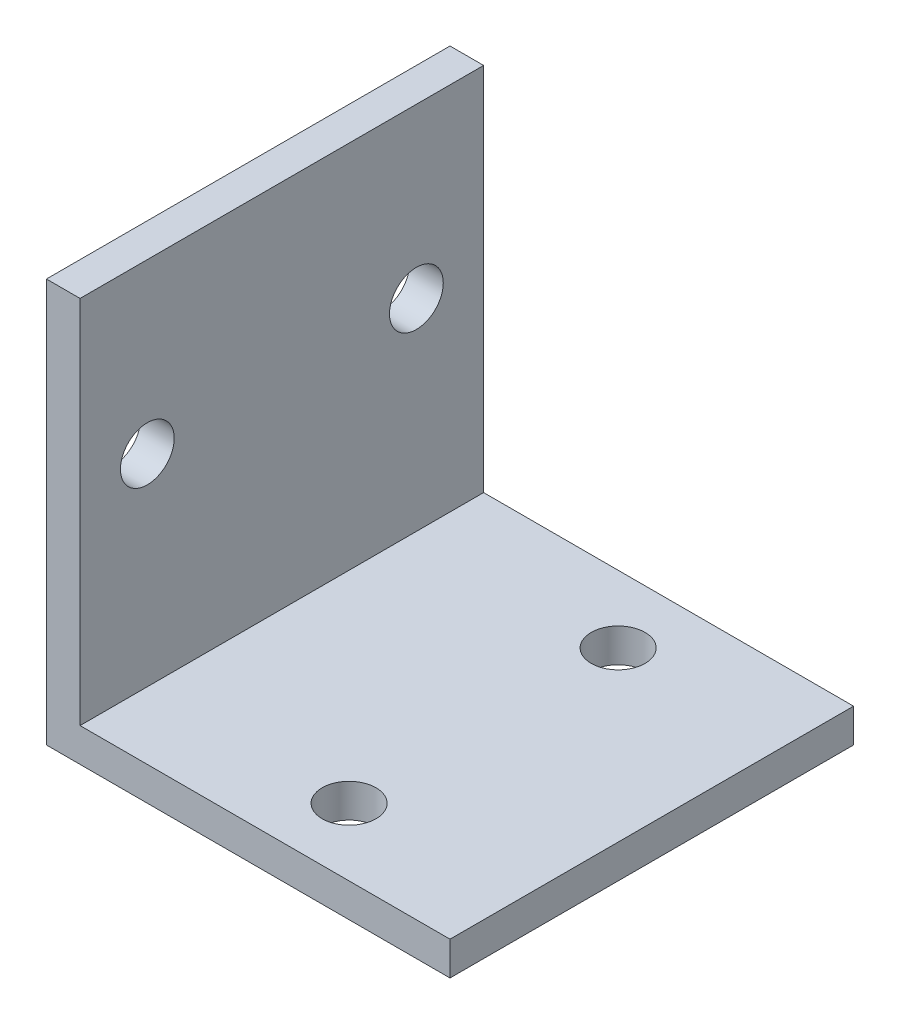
ISO-10303-21;
HEADER;
FILE_DESCRIPTION(('STEP AP214'),'2;1');
FILE_NAME('part.step','',(''),(''),'','','');
FILE_SCHEMA(('AUTOMOTIVE_DESIGN { 1 0 10303 214 1 1 1 1 }'));
ENDSEC;
DATA;
#1=APPLICATION_CONTEXT('core data for automotive mechanical design processes');
#2=APPLICATION_PROTOCOL_DEFINITION('international standard','automotive_design',2000,#1);
#3=PRODUCT_CONTEXT('',#1,'mechanical');
#4=PRODUCT('Part','Part','',(#3));
#5=PRODUCT_RELATED_PRODUCT_CATEGORY('part','',(#4));
#6=PRODUCT_DEFINITION_FORMATION('','',#4);
#7=PRODUCT_DEFINITION_CONTEXT('part definition',#1,'design');
#8=PRODUCT_DEFINITION('design','',#6,#7);
#9=PRODUCT_DEFINITION_SHAPE('','',#8);
#10=(LENGTH_UNIT() NAMED_UNIT(*) SI_UNIT(.MILLI.,.METRE.));
#11=(NAMED_UNIT(*) PLANE_ANGLE_UNIT() SI_UNIT($,.RADIAN.));
#12=(NAMED_UNIT(*) SI_UNIT($,.STERADIAN.) SOLID_ANGLE_UNIT());
#13=UNCERTAINTY_MEASURE_WITH_UNIT(LENGTH_MEASURE(1.E-05),#10,'distance_accuracy_value','');
#14=(GEOMETRIC_REPRESENTATION_CONTEXT(3) GLOBAL_UNCERTAINTY_ASSIGNED_CONTEXT((#13)) GLOBAL_UNIT_ASSIGNED_CONTEXT((#10,
#11,#12)) REPRESENTATION_CONTEXT('',''));
#15=CARTESIAN_POINT('',(0.,0.,0.));
#16=DIRECTION('',(0.,0.,1.));
#17=DIRECTION('',(1.,0.,0.));
#18=AXIS2_PLACEMENT_3D('',#15,#16,#17);
#19=CARTESIAN_POINT('',(0.,60.,30.));
#20=DIRECTION('',(0.,-1.,0.));
#21=DIRECTION('',(0.,0.,-1.));
#22=AXIS2_PLACEMENT_3D('',#19,#20,#21);
#23=PLANE('',#22);
#24=DIRECTION('',(-1.,0.,0.));
#25=VECTOR('',#24,1.);
#26=CARTESIAN_POINT('',(0.,60.,-30.));
#27=LINE('',#26,#25);
#28=CARTESIAN_POINT('',(5.,60.,-30.));
#29=VERTEX_POINT('',#28);
#30=CARTESIAN_POINT('',(0.,60.,-30.));
#31=VERTEX_POINT('',#30);
#32=EDGE_CURVE('E122',#29,#31,#27,.T.);
#33=ORIENTED_EDGE('',*,*,#32,.T.);
#34=DIRECTION('',(0.,0.,-1.));
#35=VECTOR('',#34,1.);
#36=CARTESIAN_POINT('',(0.,60.,30.));
#37=LINE('',#36,#35);
#38=CARTESIAN_POINT('',(0.,60.,30.));
#39=VERTEX_POINT('',#38);
#40=EDGE_CURVE('E11',#39,#31,#37,.T.);
#41=ORIENTED_EDGE('',*,*,#40,.F.);
#42=DIRECTION('',(-1.,0.,0.));
#43=VECTOR('',#42,1.);
#44=CARTESIAN_POINT('',(0.,60.,30.));
#45=LINE('',#44,#43);
#46=CARTESIAN_POINT('',(5.,60.,30.));
#47=VERTEX_POINT('',#46);
#48=EDGE_CURVE('E133',#47,#39,#45,.T.);
#49=ORIENTED_EDGE('',*,*,#48,.F.);
#50=DIRECTION('',(0.,0.,-1.));
#51=VECTOR('',#50,1.);
#52=CARTESIAN_POINT('',(5.,60.,30.));
#53=LINE('',#52,#51);
#54=EDGE_CURVE('E118',#47,#29,#53,.T.);
#55=ORIENTED_EDGE('',*,*,#54,.T.);
#56=EDGE_LOOP('',(#33,#41,#49,#55));
#57=FACE_BOUND('',#56,.T.);
#58=ADVANCED_FACE('F38',(#57),#23,.F.);
#59=CARTESIAN_POINT('',(0.,60.,30.));
#60=DIRECTION('',(1.,0.,0.));
#61=DIRECTION('',(0.,1.,0.));
#62=AXIS2_PLACEMENT_3D('',#59,#60,#61);
#63=PLANE('',#62);
#64=CARTESIAN_POINT('',(0.,35.,20.));
#65=DIRECTION('',(1.,0.,0.));
#66=DIRECTION('',(0.,0.,-1.));
#67=AXIS2_PLACEMENT_3D('',#64,#65,#66);
#68=CIRCLE('',#67,4.);
#69=CARTESIAN_POINT('',(0.,35.,16.));
#70=VERTEX_POINT('',#69);
#71=EDGE_CURVE('E284',#70,#70,#68,.T.);
#72=ORIENTED_EDGE('',*,*,#71,.T.);
#73=EDGE_LOOP('',(#72));
#74=FACE_BOUND('',#73,.T.);
#75=CARTESIAN_POINT('',(0.,35.,-20.));
#76=DIRECTION('',(1.,0.,0.));
#77=DIRECTION('',(0.,0.,-1.));
#78=AXIS2_PLACEMENT_3D('',#75,#76,#77);
#79=CIRCLE('',#78,4.);
#80=CARTESIAN_POINT('',(0.,35.,-24.));
#81=VERTEX_POINT('',#80);
#82=EDGE_CURVE('E287',#81,#81,#79,.T.);
#83=ORIENTED_EDGE('',*,*,#82,.T.);
#84=EDGE_LOOP('',(#83));
#85=FACE_BOUND('',#84,.T.);
#86=DIRECTION('',(0.,-1.,0.));
#87=VECTOR('',#86,1.);
#88=CARTESIAN_POINT('',(0.,60.,-30.));
#89=LINE('',#88,#87);
#90=CARTESIAN_POINT('',(0.,0.,-30.));
#91=VERTEX_POINT('',#90);
#92=EDGE_CURVE('E125',#31,#91,#89,.T.);
#93=ORIENTED_EDGE('',*,*,#92,.T.);
#94=DIRECTION('',(0.,0.,-1.));
#95=VECTOR('',#94,1.);
#96=CARTESIAN_POINT('',(0.,0.,30.));
#97=LINE('',#96,#95);
#98=CARTESIAN_POINT('',(0.,0.,30.));
#99=VERTEX_POINT('',#98);
#100=EDGE_CURVE('E46',#99,#91,#97,.T.);
#101=ORIENTED_EDGE('',*,*,#100,.F.);
#102=DIRECTION('',(0.,-1.,0.));
#103=VECTOR('',#102,1.);
#104=CARTESIAN_POINT('',(0.,60.,30.));
#105=LINE('',#104,#103);
#106=EDGE_CURVE('E91',#39,#99,#105,.T.);
#107=ORIENTED_EDGE('',*,*,#106,.F.);
#108=ORIENTED_EDGE('',*,*,#40,.T.);
#109=EDGE_LOOP('',(#93,#101,#107,#108));
#110=FACE_BOUND('',#109,.T.);
#111=ADVANCED_FACE('F161',(#74,#85,#110),#63,.F.);
#112=CARTESIAN_POINT('',(0.,0.,30.));
#113=DIRECTION('',(0.,1.,0.));
#114=DIRECTION('',(0.,0.,1.));
#115=AXIS2_PLACEMENT_3D('',#112,#113,#114);
#116=PLANE('',#115);
#117=CARTESIAN_POINT('',(35.,0.,-20.));
#118=DIRECTION('',(0.,1.,0.));
#119=DIRECTION('',(0.,0.,1.));
#120=AXIS2_PLACEMENT_3D('',#117,#118,#119);
#121=CIRCLE('',#120,4.00000000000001);
#122=CARTESIAN_POINT('',(35.,0.,-16.));
#123=VERTEX_POINT('',#122);
#124=EDGE_CURVE('E126',#123,#123,#121,.T.);
#125=ORIENTED_EDGE('',*,*,#124,.T.);
#126=EDGE_LOOP('',(#125));
#127=FACE_BOUND('',#126,.T.);
#128=CARTESIAN_POINT('',(35.,0.,20.));
#129=DIRECTION('',(0.,1.,0.));
#130=DIRECTION('',(0.,0.,1.));
#131=AXIS2_PLACEMENT_3D('',#128,#129,#130);
#132=CIRCLE('',#131,4.00000000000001);
#133=CARTESIAN_POINT('',(35.,0.,24.));
#134=VERTEX_POINT('',#133);
#135=EDGE_CURVE('E302',#134,#134,#132,.T.);
#136=ORIENTED_EDGE('',*,*,#135,.T.);
#137=EDGE_LOOP('',(#136));
#138=FACE_BOUND('',#137,.T.);
#139=DIRECTION('',(1.,0.,0.));
#140=VECTOR('',#139,1.);
#141=CARTESIAN_POINT('',(0.,0.,-30.));
#142=LINE('',#141,#140);
#143=CARTESIAN_POINT('',(60.,0.,-30.));
#144=VERTEX_POINT('',#143);
#145=EDGE_CURVE('E128',#91,#144,#142,.T.);
#146=ORIENTED_EDGE('',*,*,#145,.T.);
#147=DIRECTION('',(0.,0.,-1.));
#148=VECTOR('',#147,1.);
#149=CARTESIAN_POINT('',(60.,0.,30.));
#150=LINE('',#149,#148);
#151=CARTESIAN_POINT('',(60.,0.,30.));
#152=VERTEX_POINT('',#151);
#153=EDGE_CURVE('E113',#152,#144,#150,.T.);
#154=ORIENTED_EDGE('',*,*,#153,.F.);
#155=DIRECTION('',(1.,0.,0.));
#156=VECTOR('',#155,1.);
#157=CARTESIAN_POINT('',(0.,0.,30.));
#158=LINE('',#157,#156);
#159=EDGE_CURVE('E104',#99,#152,#158,.T.);
#160=ORIENTED_EDGE('',*,*,#159,.F.);
#161=ORIENTED_EDGE('',*,*,#100,.T.);
#162=EDGE_LOOP('',(#146,#154,#160,#161));
#163=FACE_BOUND('',#162,.T.);
#164=ADVANCED_FACE('F139',(#127,#138,#163),#116,.F.);
#165=CARTESIAN_POINT('',(60.,0.,30.));
#166=DIRECTION('',(-1.,0.,0.));
#167=DIRECTION('',(0.,0.,1.));
#168=AXIS2_PLACEMENT_3D('',#165,#166,#167);
#169=PLANE('',#168);
#170=DIRECTION('',(0.,1.,0.));
#171=VECTOR('',#170,1.);
#172=CARTESIAN_POINT('',(60.,0.,-30.));
#173=LINE('',#172,#171);
#174=CARTESIAN_POINT('',(60.,5.,-30.));
#175=VERTEX_POINT('',#174);
#176=EDGE_CURVE('E112',#144,#175,#173,.T.);
#177=ORIENTED_EDGE('',*,*,#176,.T.);
#178=DIRECTION('',(0.,0.,-1.));
#179=VECTOR('',#178,1.);
#180=CARTESIAN_POINT('',(60.,5.,30.));
#181=LINE('',#180,#179);
#182=CARTESIAN_POINT('',(60.,5.,30.));
#183=VERTEX_POINT('',#182);
#184=EDGE_CURVE('E109',#183,#175,#181,.T.);
#185=ORIENTED_EDGE('',*,*,#184,.F.);
#186=DIRECTION('',(0.,1.,0.));
#187=VECTOR('',#186,1.);
#188=CARTESIAN_POINT('',(60.,0.,30.));
#189=LINE('',#188,#187);
#190=EDGE_CURVE('E98',#152,#183,#189,.T.);
#191=ORIENTED_EDGE('',*,*,#190,.F.);
#192=ORIENTED_EDGE('',*,*,#153,.T.);
#193=EDGE_LOOP('',(#177,#185,#191,#192));
#194=FACE_BOUND('',#193,.T.);
#195=ADVANCED_FACE('F110',(#194),#169,.F.);
#196=CARTESIAN_POINT('',(5.,5.,30.));
#197=DIRECTION('',(0.,-1.,0.));
#198=DIRECTION('',(0.,0.,-1.));
#199=AXIS2_PLACEMENT_3D('',#196,#197,#198);
#200=PLANE('',#199);
#201=CARTESIAN_POINT('',(35.,5.,-20.));
#202=DIRECTION('',(0.,1.,0.));
#203=DIRECTION('',(0.,0.,1.));
#204=AXIS2_PLACEMENT_3D('',#201,#202,#203);
#205=CIRCLE('',#204,4.00000000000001);
#206=CARTESIAN_POINT('',(35.,5.,-16.));
#207=VERTEX_POINT('',#206);
#208=EDGE_CURVE('E299',#207,#207,#205,.T.);
#209=ORIENTED_EDGE('',*,*,#208,.F.);
#210=EDGE_LOOP('',(#209));
#211=FACE_BOUND('',#210,.T.);
#212=CARTESIAN_POINT('',(35.,5.,20.));
#213=DIRECTION('',(0.,1.,0.));
#214=DIRECTION('',(0.,0.,1.));
#215=AXIS2_PLACEMENT_3D('',#212,#213,#214);
#216=CIRCLE('',#215,4.00000000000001);
#217=CARTESIAN_POINT('',(35.,5.,24.));
#218=VERTEX_POINT('',#217);
#219=EDGE_CURVE('E289',#218,#218,#216,.T.);
#220=ORIENTED_EDGE('',*,*,#219,.F.);
#221=EDGE_LOOP('',(#220));
#222=FACE_BOUND('',#221,.T.);
#223=DIRECTION('',(-1.,0.,0.));
#224=VECTOR('',#223,1.);
#225=CARTESIAN_POINT('',(5.,5.,-30.));
#226=LINE('',#225,#224);
#227=CARTESIAN_POINT('',(5.,5.,-30.));
#228=VERTEX_POINT('',#227);
#229=EDGE_CURVE('E77',#175,#228,#226,.T.);
#230=ORIENTED_EDGE('',*,*,#229,.T.);
#231=DIRECTION('',(0.,0.,-1.));
#232=VECTOR('',#231,1.);
#233=CARTESIAN_POINT('',(5.,5.,30.));
#234=LINE('',#233,#232);
#235=CARTESIAN_POINT('',(5.,5.,30.));
#236=VERTEX_POINT('',#235);
#237=EDGE_CURVE('E114',#236,#228,#234,.T.);
#238=ORIENTED_EDGE('',*,*,#237,.F.);
#239=DIRECTION('',(-1.,0.,0.));
#240=VECTOR('',#239,1.);
#241=CARTESIAN_POINT('',(5.,5.,30.));
#242=LINE('',#241,#240);
#243=EDGE_CURVE('E102',#183,#236,#242,.T.);
#244=ORIENTED_EDGE('',*,*,#243,.F.);
#245=ORIENTED_EDGE('',*,*,#184,.T.);
#246=EDGE_LOOP('',(#230,#238,#244,#245));
#247=FACE_BOUND('',#246,.T.);
#248=ADVANCED_FACE('F116',(#211,#222,#247),#200,.F.);
#249=CARTESIAN_POINT('',(5.,60.,30.));
#250=DIRECTION('',(-1.,0.,0.));
#251=DIRECTION('',(0.,0.,1.));
#252=AXIS2_PLACEMENT_3D('',#249,#250,#251);
#253=PLANE('',#252);
#254=CARTESIAN_POINT('',(5.,35.,20.));
#255=DIRECTION('',(1.,0.,0.));
#256=DIRECTION('',(0.,0.,-1.));
#257=AXIS2_PLACEMENT_3D('',#254,#255,#256);
#258=CIRCLE('',#257,4.);
#259=CARTESIAN_POINT('',(5.,35.,16.));
#260=VERTEX_POINT('',#259);
#261=EDGE_CURVE('E286',#260,#260,#258,.T.);
#262=ORIENTED_EDGE('',*,*,#261,.F.);
#263=EDGE_LOOP('',(#262));
#264=FACE_BOUND('',#263,.T.);
#265=CARTESIAN_POINT('',(5.,35.,-20.));
#266=DIRECTION('',(1.,0.,0.));
#267=DIRECTION('',(0.,0.,-1.));
#268=AXIS2_PLACEMENT_3D('',#265,#266,#267);
#269=CIRCLE('',#268,4.);
#270=CARTESIAN_POINT('',(5.,35.,-24.));
#271=VERTEX_POINT('',#270);
#272=EDGE_CURVE('E292',#271,#271,#269,.T.);
#273=ORIENTED_EDGE('',*,*,#272,.F.);
#274=EDGE_LOOP('',(#273));
#275=FACE_BOUND('',#274,.T.);
#276=DIRECTION('',(0.,1.,0.));
#277=VECTOR('',#276,1.);
#278=CARTESIAN_POINT('',(5.,60.,-30.));
#279=LINE('',#278,#277);
#280=EDGE_CURVE('E83',#228,#29,#279,.T.);
#281=ORIENTED_EDGE('',*,*,#280,.T.);
#282=ORIENTED_EDGE('',*,*,#54,.F.);
#283=DIRECTION('',(0.,1.,0.));
#284=VECTOR('',#283,1.);
#285=CARTESIAN_POINT('',(5.,60.,30.));
#286=LINE('',#285,#284);
#287=EDGE_CURVE('E54',#236,#47,#286,.T.);
#288=ORIENTED_EDGE('',*,*,#287,.F.);
#289=ORIENTED_EDGE('',*,*,#237,.T.);
#290=EDGE_LOOP('',(#281,#282,#288,#289));
#291=FACE_BOUND('',#290,.T.);
#292=ADVANCED_FACE('F146',(#264,#275,#291),#253,.F.);
#293=CARTESIAN_POINT('',(0.,0.,30.));
#294=DIRECTION('',(0.,0.,-1.));
#295=DIRECTION('',(-1.,0.,0.));
#296=AXIS2_PLACEMENT_3D('',#293,#294,#295);
#297=PLANE('',#296);
#298=ORIENTED_EDGE('',*,*,#48,.T.);
#299=ORIENTED_EDGE('',*,*,#106,.T.);
#300=ORIENTED_EDGE('',*,*,#159,.T.);
#301=ORIENTED_EDGE('',*,*,#190,.T.);
#302=ORIENTED_EDGE('',*,*,#243,.T.);
#303=ORIENTED_EDGE('',*,*,#287,.T.);
#304=EDGE_LOOP('',(#298,#299,#300,#301,#302,#303));
#305=FACE_BOUND('',#304,.T.);
#306=ADVANCED_FACE('F100',(#305),#297,.F.);
#307=CARTESIAN_POINT('',(0.,0.,-30.));
#308=DIRECTION('',(0.,0.,-1.));
#309=DIRECTION('',(-1.,0.,0.));
#310=AXIS2_PLACEMENT_3D('',#307,#308,#309);
#311=PLANE('',#310);
#312=ORIENTED_EDGE('',*,*,#32,.F.);
#313=ORIENTED_EDGE('',*,*,#280,.F.);
#314=ORIENTED_EDGE('',*,*,#229,.F.);
#315=ORIENTED_EDGE('',*,*,#176,.F.);
#316=ORIENTED_EDGE('',*,*,#145,.F.);
#317=ORIENTED_EDGE('',*,*,#92,.F.);
#318=EDGE_LOOP('',(#312,#313,#314,#315,#316,#317));
#319=FACE_BOUND('',#318,.T.);
#320=ADVANCED_FACE('F142',(#319),#311,.T.);
#321=CARTESIAN_POINT('',(35.,0.,20.));
#322=DIRECTION('',(0.,1.,0.));
#323=DIRECTION('',(0.,0.,1.));
#324=AXIS2_PLACEMENT_3D('',#321,#322,#323);
#325=CYLINDRICAL_SURFACE('',#324,4.00000000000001);
#326=ORIENTED_EDGE('',*,*,#135,.F.);
#327=EDGE_LOOP('',(#326));
#328=FACE_BOUND('',#327,.T.);
#329=ORIENTED_EDGE('',*,*,#219,.T.);
#330=EDGE_LOOP('',(#329));
#331=FACE_BOUND('',#330,.T.);
#332=ADVANCED_FACE('F194',(#328,#331),#325,.F.);
#333=CARTESIAN_POINT('',(35.,0.,-20.));
#334=DIRECTION('',(0.,1.,0.));
#335=DIRECTION('',(0.,0.,1.));
#336=AXIS2_PLACEMENT_3D('',#333,#334,#335);
#337=CYLINDRICAL_SURFACE('',#336,4.00000000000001);
#338=ORIENTED_EDGE('',*,*,#124,.F.);
#339=EDGE_LOOP('',(#338));
#340=FACE_BOUND('',#339,.T.);
#341=ORIENTED_EDGE('',*,*,#208,.T.);
#342=EDGE_LOOP('',(#341));
#343=FACE_BOUND('',#342,.T.);
#344=ADVANCED_FACE('F199',(#340,#343),#337,.F.);
#345=CARTESIAN_POINT('',(0.,35.,-20.));
#346=DIRECTION('',(1.,0.,0.));
#347=DIRECTION('',(0.,0.,-1.));
#348=AXIS2_PLACEMENT_3D('',#345,#346,#347);
#349=CYLINDRICAL_SURFACE('',#348,4.);
#350=ORIENTED_EDGE('',*,*,#82,.F.);
#351=EDGE_LOOP('',(#350));
#352=FACE_BOUND('',#351,.T.);
#353=ORIENTED_EDGE('',*,*,#272,.T.);
#354=EDGE_LOOP('',(#353));
#355=FACE_BOUND('',#354,.T.);
#356=ADVANCED_FACE('F211',(#352,#355),#349,.F.);
#357=CARTESIAN_POINT('',(0.,35.,20.));
#358=DIRECTION('',(1.,0.,0.));
#359=DIRECTION('',(0.,0.,-1.));
#360=AXIS2_PLACEMENT_3D('',#357,#358,#359);
#361=CYLINDRICAL_SURFACE('',#360,4.);
#362=ORIENTED_EDGE('',*,*,#71,.F.);
#363=EDGE_LOOP('',(#362));
#364=FACE_BOUND('',#363,.T.);
#365=ORIENTED_EDGE('',*,*,#261,.T.);
#366=EDGE_LOOP('',(#365));
#367=FACE_BOUND('',#366,.T.);
#368=ADVANCED_FACE('F234',(#364,#367),#361,.F.);
#369=CLOSED_SHELL('',(#58,#111,#164,#195,#248,#292,#306,#320,#332,#344,#356,#368));
#370=MANIFOLD_SOLID_BREP('B2',#369);
#371=ADVANCED_BREP_SHAPE_REPRESENTATION('',(#18,#370),#14);
#372=SHAPE_DEFINITION_REPRESENTATION(#9,#371);
ENDSEC;
END-ISO-10303-21;
